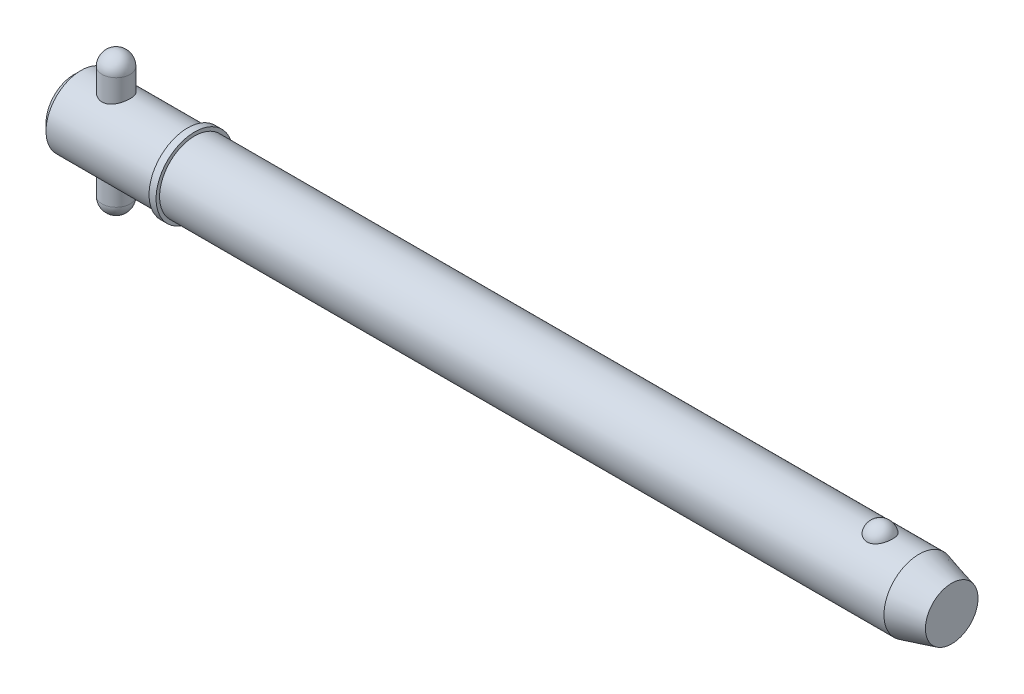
ISO-10303-21;
HEADER;
FILE_DESCRIPTION(('STEP AP214'),'2;1');
FILE_NAME('part.step','',(''),(''),'','','');
FILE_SCHEMA(('AUTOMOTIVE_DESIGN { 1 0 10303 214 1 1 1 1 }'));
ENDSEC;
DATA;
#1=APPLICATION_CONTEXT('core data for automotive mechanical design processes');
#2=APPLICATION_PROTOCOL_DEFINITION('international standard','automotive_design',2000,#1);
#3=PRODUCT_CONTEXT('',#1,'mechanical');
#4=PRODUCT('Part','Part','',(#3));
#5=PRODUCT_RELATED_PRODUCT_CATEGORY('part','',(#4));
#6=PRODUCT_DEFINITION_FORMATION('','',#4);
#7=PRODUCT_DEFINITION_CONTEXT('part definition',#1,'design');
#8=PRODUCT_DEFINITION('design','',#6,#7);
#9=PRODUCT_DEFINITION_SHAPE('','',#8);
#10=(LENGTH_UNIT() NAMED_UNIT(*) SI_UNIT(.MILLI.,.METRE.));
#11=(NAMED_UNIT(*) PLANE_ANGLE_UNIT() SI_UNIT($,.RADIAN.));
#12=(NAMED_UNIT(*) SI_UNIT($,.STERADIAN.) SOLID_ANGLE_UNIT());
#13=UNCERTAINTY_MEASURE_WITH_UNIT(LENGTH_MEASURE(1.E-05),#10,'distance_accuracy_value','');
#14=(GEOMETRIC_REPRESENTATION_CONTEXT(3) GLOBAL_UNCERTAINTY_ASSIGNED_CONTEXT((#13)) GLOBAL_UNIT_ASSIGNED_CONTEXT((#10,
#11,#12)) REPRESENTATION_CONTEXT('',''));
#15=CARTESIAN_POINT('',(0.,0.,0.));
#16=DIRECTION('',(0.,0.,1.));
#17=DIRECTION('',(1.,0.,0.));
#18=AXIS2_PLACEMENT_3D('',#15,#16,#17);
#19=CARTESIAN_POINT('',(9.525,15.875,0.));
#20=DIRECTION('',(0.,-1.,0.));
#21=DIRECTION('',(0.,0.,-1.));
#22=AXIS2_PLACEMENT_3D('',#19,#20,#21);
#23=CYLINDRICAL_SURFACE('',#22,3.175);
#24=CARTESIAN_POINT('',(9.525,-12.7,0.));
#25=DIRECTION('',(0.,-1.,0.));
#26=DIRECTION('',(0.,0.,-1.));
#27=AXIS2_PLACEMENT_3D('',#24,#25,#26);
#28=CIRCLE('',#27,3.175);
#29=CARTESIAN_POINT('',(9.525,-12.7,-3.175));
#30=VERTEX_POINT('',#29);
#31=EDGE_CURVE('P0_E10',#30,#30,#28,.F.);
#32=ORIENTED_EDGE('',*,*,#31,.T.);
#33=EDGE_LOOP('',(#32));
#34=FACE_BOUND('',#33,.T.);
#35=CARTESIAN_POINT('',(9.525,12.7,0.));
#36=DIRECTION('',(0.,-1.,0.));
#37=DIRECTION('',(0.,0.,-1.));
#38=AXIS2_PLACEMENT_3D('',#35,#36,#37);
#39=CIRCLE('',#38,3.175);
#40=CARTESIAN_POINT('',(9.525,12.7,-3.175));
#41=VERTEX_POINT('',#40);
#42=EDGE_CURVE('P0_E21',#41,#41,#39,.T.);
#43=ORIENTED_EDGE('',*,*,#42,.T.);
#44=EDGE_LOOP('',(#43));
#45=FACE_BOUND('',#44,.T.);
#46=ADVANCED_FACE('P0_F14',(#34,#45),#23,.T.);
#47=CARTESIAN_POINT('',(9.525,-12.7,0.));
#48=DIRECTION('',(0.,0.,1.));
#49=DIRECTION('',(1.,0.,0.));
#50=AXIS2_PLACEMENT_3D('',#47,#48,#49);
#51=SPHERICAL_SURFACE('',#50,3.175);
#52=CARTESIAN_POINT('',(9.525,-12.7,0.));
#53=DIRECTION('',(0.,-1.,0.));
#54=DIRECTION('',(0.,0.,-1.));
#55=AXIS2_PLACEMENT_3D('',#52,#53,#54);
#56=SPHERICAL_SURFACE('',#55,3.175);
#57=ORIENTED_EDGE('',*,*,#31,.F.);
#58=EDGE_LOOP('',(#57));
#59=FACE_BOUND('',#58,.T.);
#60=ADVANCED_FACE('P0_F29',(#59),#56,.T.);
#61=CARTESIAN_POINT('',(9.525,12.7,0.));
#62=DIRECTION('',(0.,0.,1.));
#63=DIRECTION('',(1.,0.,0.));
#64=AXIS2_PLACEMENT_3D('',#61,#62,#63);
#65=SPHERICAL_SURFACE('',#64,3.175);
#66=CARTESIAN_POINT('',(9.525,12.7,0.));
#67=DIRECTION('',(0.,-1.,0.));
#68=DIRECTION('',(0.,0.,-1.));
#69=AXIS2_PLACEMENT_3D('',#66,#67,#68);
#70=SPHERICAL_SURFACE('',#69,3.175);
#71=ORIENTED_EDGE('',*,*,#42,.F.);
#72=EDGE_LOOP('',(#71));
#73=FACE_BOUND('',#72,.T.);
#74=ADVANCED_FACE('P0_F16',(#73),#70,.T.);
#75=CLOSED_SHELL('',(#46,#60,#74));
#76=MANIFOLD_SOLID_BREP('P0_B1',#75);
#77=CARTESIAN_POINT('',(0.,0.,0.));
#78=DIRECTION('',(1.,0.,0.));
#79=DIRECTION('',(0.,0.,-1.));
#80=AXIS2_PLACEMENT_3D('',#77,#78,#79);
#81=CYLINDRICAL_SURFACE('',#80,7.94);
#82=CARTESIAN_POINT('',(191.351879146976,0.,0.));
#83=DIRECTION('',(1.,0.,0.));
#84=DIRECTION('',(0.,0.,-1.));
#85=AXIS2_PLACEMENT_3D('',#82,#83,#84);
#86=CIRCLE('',#85,7.94);
#87=CARTESIAN_POINT('',(191.351879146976,0.,-7.94));
#88=VERTEX_POINT('',#87);
#89=EDGE_CURVE('P1_E81',#88,#88,#86,.T.);
#90=ORIENTED_EDGE('',*,*,#89,.F.);
#91=EDGE_LOOP('',(#90));
#92=FACE_BOUND('',#91,.T.);
#93=CARTESIAN_POINT('',(27.31,0.,0.));
#94=DIRECTION('',(1.,0.,0.));
#95=DIRECTION('',(0.,0.,-1.));
#96=AXIS2_PLACEMENT_3D('',#93,#94,#95);
#97=CIRCLE('',#96,7.94);
#98=CARTESIAN_POINT('',(27.31,0.,-7.94));
#99=VERTEX_POINT('',#98);
#100=EDGE_CURVE('P1_E85',#99,#99,#97,.T.);
#101=ORIENTED_EDGE('',*,*,#100,.T.);
#102=EDGE_LOOP('',(#101));
#103=FACE_BOUND('',#102,.T.);
#104=CARTESIAN_POINT('',(182.544907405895,7.37767842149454,2.93486986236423));
#105=CARTESIAN_POINT('',(182.392749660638,7.3776732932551,2.93487505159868));
#106=CARTESIAN_POINT('',(182.240632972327,7.38258419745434,2.92262454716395));
#107=CARTESIAN_POINT('',(181.940928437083,7.40163229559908,2.87404196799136));
#108=CARTESIAN_POINT('',(181.793339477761,7.41576720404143,2.83771585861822));
#109=CARTESIAN_POINT('',(181.507018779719,7.45161576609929,2.74218769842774));
#110=CARTESIAN_POINT('',(181.368274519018,7.47331841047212,2.68301886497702));
#111=CARTESIAN_POINT('',(181.102882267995,7.52194082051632,2.54350967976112));
#112=CARTESIAN_POINT('',(180.976236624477,7.54886159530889,2.46316523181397));
#113=CARTESIAN_POINT('',(180.734534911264,7.60594671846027,2.28090375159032));
#114=CARTESIAN_POINT('',(180.619906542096,7.63618114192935,2.1784421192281));
#115=CARTESIAN_POINT('',(180.408878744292,7.69614046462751,1.95608495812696));
#116=CARTESIAN_POINT('',(180.312482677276,7.72586526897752,1.83618622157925));
#117=CARTESIAN_POINT('',(180.135938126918,7.78314821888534,1.57628086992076));
#118=CARTESIAN_POINT('',(180.056707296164,7.81055035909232,1.43561546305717));
#119=CARTESIAN_POINT('',(179.921797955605,7.85879631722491,1.14236334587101));
#120=CARTESIAN_POINT('',(179.866121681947,7.87963951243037,0.989775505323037));
#121=CARTESIAN_POINT('',(179.77881215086,7.91289645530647,0.674619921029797));
#122=CARTESIAN_POINT('',(179.74753090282,7.92518652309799,0.511941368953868));
#123=CARTESIAN_POINT('',(179.710975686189,7.93958930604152,0.183247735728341));
#124=CARTESIAN_POINT('',(179.705701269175,7.94170219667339,0.0172327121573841));
#125=CARTESIAN_POINT('',(179.721231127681,7.93554931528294,-0.312672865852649));
#126=CARTESIAN_POINT('',(179.741925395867,7.92732732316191,-0.476569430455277));
#127=CARTESIAN_POINT('',(179.80878655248,7.90141534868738,-0.79830524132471));
#128=CARTESIAN_POINT('',(179.854953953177,7.88372517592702,-0.956144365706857));
#129=CARTESIAN_POINT('',(179.971898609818,7.84066230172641,-1.26152073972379));
#130=CARTESIAN_POINT('',(180.042704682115,7.81528060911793,-1.40904568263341));
#131=CARTESIAN_POINT('',(180.207478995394,7.75948672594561,-1.68950598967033));
#132=CARTESIAN_POINT('',(180.301448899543,7.72907417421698,-1.82244030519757));
#133=CARTESIAN_POINT('',(180.510839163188,7.66640424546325,-2.07032792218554));
#134=CARTESIAN_POINT('',(180.626315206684,7.63414223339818,-2.18523308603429));
#135=CARTESIAN_POINT('',(180.8759006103,7.57149681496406,-2.39329737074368));
#136=CARTESIAN_POINT('',(181.010008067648,7.54111321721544,-2.48645870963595));
#137=CARTESIAN_POINT('',(181.290111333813,7.48650742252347,-2.64628132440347));
#138=CARTESIAN_POINT('',(181.435760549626,7.46215900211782,-2.71350554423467));
#139=CARTESIAN_POINT('',(181.737425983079,7.42171253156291,-2.82226614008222));
#140=CARTESIAN_POINT('',(181.893438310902,7.40561140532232,-2.86381209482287));
#141=CARTESIAN_POINT('',(182.202970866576,7.3842679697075,-2.9183907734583));
#142=CARTESIAN_POINT('',(182.356222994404,7.37852109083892,-2.93275024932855));
#143=CARTESIAN_POINT('',(182.663070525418,7.37700973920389,-2.93655208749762));
#144=CARTESIAN_POINT('',(182.816665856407,7.38124333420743,-2.92599927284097));
#145=CARTESIAN_POINT('',(183.114990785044,7.39890635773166,-2.88102897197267));
#146=CARTESIAN_POINT('',(183.259848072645,7.41205491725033,-2.84733999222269));
#147=CARTESIAN_POINT('',(183.54164329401,7.445801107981,-2.75788206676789));
#148=CARTESIAN_POINT('',(183.678580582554,7.46639934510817,-2.70211132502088));
#149=CARTESIAN_POINT('',(183.944061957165,7.51339098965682,-2.56858908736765));
#150=CARTESIAN_POINT('',(184.072354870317,7.53990200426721,-2.4903806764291));
#151=CARTESIAN_POINT('',(184.314244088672,7.59569503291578,-2.31462737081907));
#152=CARTESIAN_POINT('',(184.427837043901,7.6249776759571,-2.21707808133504));
#153=CARTESIAN_POINT('',(184.64322156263,7.68489473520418,-1.99982049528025));
#154=CARTESIAN_POINT('',(184.744148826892,7.71552419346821,-1.87925337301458));
#155=CARTESIAN_POINT('',(184.925186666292,7.77353016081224,-1.6226882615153));
#156=CARTESIAN_POINT('',(185.005293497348,7.80090608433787,-1.48668750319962));
#157=CARTESIAN_POINT('',(185.145361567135,7.85047992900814,-1.1981841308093));
#158=CARTESIAN_POINT('',(185.204587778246,7.87248183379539,-1.04529016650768));
#159=CARTESIAN_POINT('',(185.297982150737,7.90785114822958,-0.731080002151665));
#160=CARTESIAN_POINT('',(185.332149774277,7.92121837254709,-0.569763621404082));
#161=CARTESIAN_POINT('',(185.374795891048,7.93797834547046,-0.242812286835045));
#162=CARTESIAN_POINT('',(185.383204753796,7.94134405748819,-0.0771668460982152));
#163=CARTESIAN_POINT('',(185.373962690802,7.93767937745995,0.253276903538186));
#164=CARTESIAN_POINT('',(185.356312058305,7.93064910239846,0.418075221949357));
#165=CARTESIAN_POINT('',(185.295424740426,7.90695571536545,0.741525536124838));
#166=CARTESIAN_POINT('',(185.252281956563,7.8903279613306,0.900197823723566));
#167=CARTESIAN_POINT('',(185.14135358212,7.84916386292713,1.20759654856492));
#168=CARTESIAN_POINT('',(185.07356656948,7.82462706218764,1.35632241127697));
#169=CARTESIAN_POINT('',(184.914371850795,7.77006699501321,1.64032869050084));
#170=CARTESIAN_POINT('',(184.822861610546,7.74002008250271,1.7755471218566));
#171=CARTESIAN_POINT('',(184.618296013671,7.67774175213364,2.0280064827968));
#172=CARTESIAN_POINT('',(184.505241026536,7.64551037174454,2.14524772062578));
#173=CARTESIAN_POINT('',(184.260831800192,7.58265895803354,2.35778002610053));
#174=CARTESIAN_POINT('',(184.129583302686,7.5520309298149,2.45319004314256));
#175=CARTESIAN_POINT('',(183.851601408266,7.49579792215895,2.61999897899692));
#176=CARTESIAN_POINT('',(183.704867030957,7.4701932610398,2.69139637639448));
#177=CARTESIAN_POINT('',(183.392947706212,7.42622216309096,2.8105324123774));
#178=CARTESIAN_POINT('',(183.227220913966,7.40825002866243,2.85700910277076));
#179=CARTESIAN_POINT('',(182.889279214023,7.38398348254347,2.9191685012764));
#180=CARTESIAN_POINT('',(182.71706702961,7.3776842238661,2.93486399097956));
#181=CARTESIAN_POINT('',(182.544907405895,7.37767842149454,2.93486986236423));
#182=B_SPLINE_CURVE_WITH_KNOTS('',3,(#104,#105,#106,#107,#108,#109,#110,#111,#112,#113,#114,
#115,#116,#117,#118,#119,#120,#121,#122,#123,#124,#125,#126,#127,#128,#129,#130,#131,#132,#133,
#134,#135,#136,#137,#138,#139,#140,#141,#142,#143,#144,#145,#146,#147,#148,#149,#150,#151,#152,
#153,#154,#155,#156,#157,#158,#159,#160,#161,#162,#163,#164,#165,#166,#167,#168,#169,#170,#171,
#172,#173,#174,#175,#176,#177,#178,#179,#180,#181),.UNSPECIFIED.,.T.,.F.,(4,2,2,2,2,2,2,2,2,2,2,
2,2,2,2,2,2,2,2,2,2,2,2,2,2,2,2,2,2,2,2,2,2,2,2,2,2,2,4),(0.,0.455841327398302,
0.911569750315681,1.36663794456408,1.82179423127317,2.2897898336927,2.75787163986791,
3.24685368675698,3.73588214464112,4.23184282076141,4.72779494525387,5.22165321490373,
5.71552141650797,6.2099691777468,6.7044524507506,7.20023431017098,7.69596557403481,
8.18023418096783,8.66432203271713,9.1241069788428,9.58380291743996,10.0296503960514,
10.4755341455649,10.9312349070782,11.3870393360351,11.8654416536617,12.3439299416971,
12.8378875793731,13.3318558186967,13.8271581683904,14.3224549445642,14.8159385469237,
15.3094506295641,15.8051323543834,16.3008055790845,16.7937101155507,17.2866458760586,
17.8026240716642,18.3183879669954),.UNSPECIFIED.);
#183=CARTESIAN_POINT('',(182.544907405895,7.37767842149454,2.93486986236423));
#184=VERTEX_POINT('',#183);
#185=EDGE_CURVE('P1_E35',#184,#184,#182,.T.);
#186=ORIENTED_EDGE('',*,*,#185,.T.);
#187=EDGE_LOOP('',(#186));
#188=FACE_BOUND('',#187,.T.);
#189=ADVANCED_FACE('P1_F13',(#92,#103,#188),#81,.T.);
#190=CARTESIAN_POINT('',(0.,0.,0.));
#191=DIRECTION('',(-1.,0.,0.));
#192=DIRECTION('',(0.,0.,1.));
#193=AXIS2_PLACEMENT_3D('',#190,#191,#192);
#194=PLANE('',#193);
#195=CARTESIAN_POINT('',(0.,0.,0.));
#196=DIRECTION('',(1.,0.,0.));
#197=DIRECTION('',(0.,0.,-1.));
#198=AXIS2_PLACEMENT_3D('',#195,#196,#197);
#199=CIRCLE('',#198,6.352);
#200=CARTESIAN_POINT('',(0.,0.,-6.352));
#201=VERTEX_POINT('',#200);
#202=EDGE_CURVE('P1_E9',#201,#201,#199,.T.);
#203=ORIENTED_EDGE('',*,*,#202,.F.);
#204=EDGE_LOOP('',(#203));
#205=FACE_BOUND('',#204,.T.);
#206=ADVANCED_FACE('P1_F15',(#205),#194,.T.);
#207=CARTESIAN_POINT('',(1.58799999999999,0.,0.));
#208=DIRECTION('',(1.,0.,0.));
#209=DIRECTION('',(0.,0.,-1.));
#210=AXIS2_PLACEMENT_3D('',#207,#208,#209);
#211=CONICAL_SURFACE('',#210,7.94,0.78539816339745);
#212=ORIENTED_EDGE('',*,*,#202,.T.);
#213=EDGE_LOOP('',(#212));
#214=FACE_BOUND('',#213,.T.);
#215=CARTESIAN_POINT('',(1.58799999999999,0.,0.));
#216=DIRECTION('',(1.,0.,0.));
#217=DIRECTION('',(0.,0.,-1.));
#218=AXIS2_PLACEMENT_3D('',#215,#216,#217);
#219=CIRCLE('',#218,7.94);
#220=CARTESIAN_POINT('',(1.58799999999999,0.,-7.94));
#221=VERTEX_POINT('',#220);
#222=EDGE_CURVE('P1_E26',#221,#221,#219,.T.);
#223=ORIENTED_EDGE('',*,*,#222,.F.);
#224=EDGE_LOOP('',(#223));
#225=FACE_BOUND('',#224,.T.);
#226=ADVANCED_FACE('P1_F77',(#214,#225),#211,.T.);
#227=CARTESIAN_POINT('',(0.,0.,0.));
#228=DIRECTION('',(1.,0.,0.));
#229=DIRECTION('',(0.,0.,-1.));
#230=AXIS2_PLACEMENT_3D('',#227,#228,#229);
#231=CYLINDRICAL_SURFACE('',#230,7.94);
#232=CARTESIAN_POINT('',(9.525,-7.27756655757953,3.175));
#233=CARTESIAN_POINT('',(9.43992346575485,-7.27756715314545,3.17499935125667));
#234=CARTESIAN_POINT('',(9.35481882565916,-7.27906496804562,3.1715736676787));
#235=CARTESIAN_POINT('',(9.18524505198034,-7.28499816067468,3.15791803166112));
#236=CARTESIAN_POINT('',(9.100776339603,-7.28943533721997,3.14768391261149));
#237=CARTESIAN_POINT('',(8.84895715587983,-7.30698881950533,3.10684226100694));
#238=CARTESIAN_POINT('',(8.6834173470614,-7.32434654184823,3.06609574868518));
#239=CARTESIAN_POINT('',(8.36278910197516,-7.36806950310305,2.95945910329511));
#240=CARTESIAN_POINT('',(8.20766386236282,-7.39440078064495,2.89366366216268));
#241=CARTESIAN_POINT('',(7.91065319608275,-7.45304562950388,2.73907413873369));
#242=CARTESIAN_POINT('',(7.76876488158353,-7.48535789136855,2.65028508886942));
#243=CARTESIAN_POINT('',(7.49411086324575,-7.55439482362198,2.44679888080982));
#244=CARTESIAN_POINT('',(7.36219910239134,-7.59126138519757,2.33099745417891));
#245=CARTESIAN_POINT('',(7.11904234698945,-7.66408045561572,2.07909838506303));
#246=CARTESIAN_POINT('',(7.00780457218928,-7.70003264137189,1.94299368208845));
#247=CARTESIAN_POINT('',(6.80492173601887,-7.76867514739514,1.64775981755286));
#248=CARTESIAN_POINT('',(6.71422139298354,-7.80118112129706,1.48793473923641));
#249=CARTESIAN_POINT('',(6.56135788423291,-7.85754918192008,1.15376269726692));
#250=CARTESIAN_POINT('',(6.49918311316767,-7.88141478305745,0.979421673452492));
#251=CARTESIAN_POINT('',(6.40818142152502,-7.91680873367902,0.630115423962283));
#252=CARTESIAN_POINT('',(6.3778864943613,-7.9288781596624,0.455588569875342));
#253=CARTESIAN_POINT('',(6.34677743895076,-7.94127547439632,0.103539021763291));
#254=CARTESIAN_POINT('',(6.34595232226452,-7.94160773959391,-0.0739825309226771));
#255=CARTESIAN_POINT('',(6.37300128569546,-7.93082261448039,-0.416371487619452));
#256=CARTESIAN_POINT('',(6.39926693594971,-7.92034690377,-0.581389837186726));
#257=CARTESIAN_POINT('',(6.47701615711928,-7.88998770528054,-0.904449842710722));
#258=CARTESIAN_POINT('',(6.52850157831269,-7.87010352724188,-1.06249098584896));
#259=CARTESIAN_POINT('',(6.65586120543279,-7.82249343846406,-1.36995769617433));
#260=CARTESIAN_POINT('',(6.73209124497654,-7.79465387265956,-1.51921754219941));
#261=CARTESIAN_POINT('',(6.90644286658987,-7.73389606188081,-1.80321183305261));
#262=CARTESIAN_POINT('',(7.00457194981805,-7.70097607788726,-1.93794127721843));
#263=CARTESIAN_POINT('',(7.22744086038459,-7.63084889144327,-2.19843606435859));
#264=CARTESIAN_POINT('',(7.35350432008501,-7.59350211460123,-2.3230330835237));
#265=CARTESIAN_POINT('',(7.62488266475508,-7.52039654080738,-2.54979642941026));
#266=CARTESIAN_POINT('',(7.77020381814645,-7.48463826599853,-2.65195542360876));
#267=CARTESIAN_POINT('',(8.08119298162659,-7.41780943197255,-2.83361305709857));
#268=CARTESIAN_POINT('',(8.24731937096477,-7.38689959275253,-2.91239105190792));
#269=CARTESIAN_POINT('',(8.59204539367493,-7.33515216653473,-3.04038913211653));
#270=CARTESIAN_POINT('',(8.77063684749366,-7.31430804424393,-3.08962840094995));
#271=CARTESIAN_POINT('',(9.12356982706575,-7.28663831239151,-3.15431018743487));
#272=CARTESIAN_POINT('',(9.29750494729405,-7.2790344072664,-3.17163284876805));
#273=CARTESIAN_POINT('',(9.64592502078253,-7.27648884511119,-3.17747282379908));
#274=CARTESIAN_POINT('',(9.82040979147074,-7.28154335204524,-3.16599886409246));
#275=CARTESIAN_POINT('',(10.1545374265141,-7.30294638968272,-3.11628310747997));
#276=CARTESIAN_POINT('',(10.3144598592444,-7.31863587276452,-3.0796016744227));
#277=CARTESIAN_POINT('',(10.625774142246,-7.35872371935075,-2.98253618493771));
#278=CARTESIAN_POINT('',(10.7771640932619,-7.38312401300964,-2.92214687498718));
#279=CARTESIAN_POINT('',(11.0739599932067,-7.4390944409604,-2.77664664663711));
#280=CARTESIAN_POINT('',(11.2188745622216,-7.47091513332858,-2.69063278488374));
#281=CARTESIAN_POINT('',(11.4928722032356,-7.53775867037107,-2.49724834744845));
#282=CARTESIAN_POINT('',(11.6219487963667,-7.57278281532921,-2.38986907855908));
#283=CARTESIAN_POINT('',(11.8705091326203,-7.64520845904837,-2.1474449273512));
#284=CARTESIAN_POINT('',(11.9885816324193,-7.68259462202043,-2.01094304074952));
#285=CARTESIAN_POINT('',(12.2003631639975,-7.75309951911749,-1.71917041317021));
#286=CARTESIAN_POINT('',(12.2940712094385,-7.78621808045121,-1.56389891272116));
#287=CARTESIAN_POINT('',(12.4541161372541,-7.84456050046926,-1.23845027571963));
#288=CARTESIAN_POINT('',(12.5204600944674,-7.86978639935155,-1.06827700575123));
#289=CARTESIAN_POINT('',(12.6231407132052,-7.90943635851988,-0.717928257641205));
#290=CARTESIAN_POINT('',(12.6594936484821,-7.92386627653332,-0.537758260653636));
#291=CARTESIAN_POINT('',(12.6992281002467,-7.93967263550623,-0.185201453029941));
#292=CARTESIAN_POINT('',(12.7046050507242,-7.94183891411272,-0.0130732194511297));
#293=CARTESIAN_POINT('',(12.6875036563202,-7.9350072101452,0.329549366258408));
#294=CARTESIAN_POINT('',(12.6650295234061,-7.92601091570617,0.500043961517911));
#295=CARTESIAN_POINT('',(12.5942896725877,-7.89825976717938,0.829196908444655));
#296=CARTESIAN_POINT('',(12.5468364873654,-7.87981280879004,0.988057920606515));
#297=CARTESIAN_POINT('',(12.4283390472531,-7.83513565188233,1.29553461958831));
#298=CARTESIAN_POINT('',(12.3572904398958,-7.8089040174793,1.44414841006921));
#299=CARTESIAN_POINT('',(12.1900822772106,-7.7497911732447,1.73412879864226));
#300=CARTESIAN_POINT('',(12.0929519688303,-7.71666737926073,1.87488510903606));
#301=CARTESIAN_POINT('',(11.8777894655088,-7.64775894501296,2.13869231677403));
#302=CARTESIAN_POINT('',(11.7597486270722,-7.61197320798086,2.26173585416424));
#303=CARTESIAN_POINT('',(11.4974896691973,-7.53902341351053,2.49449755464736));
#304=CARTESIAN_POINT('',(11.3521039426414,-7.50191102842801,2.60292060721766));
#305=CARTESIAN_POINT('',(11.0440201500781,-7.43289551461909,2.79392602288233));
#306=CARTESIAN_POINT('',(10.8813200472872,-7.40099299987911,2.87650534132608));
#307=CARTESIAN_POINT('',(10.558064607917,-7.3489506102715,3.00682739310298));
#308=CARTESIAN_POINT('',(10.398627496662,-7.32801197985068,3.05703164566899));
#309=CARTESIAN_POINT('',(10.0731242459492,-7.29639491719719,3.13175843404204));
#310=CARTESIAN_POINT('',(9.90707793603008,-7.28568789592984,3.15635254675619));
#311=CARTESIAN_POINT('',(9.70441566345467,-7.27968826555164,3.17013149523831));
#312=CARTESIAN_POINT('',(9.66856669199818,-7.27889378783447,3.17195593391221));
#313=CARTESIAN_POINT('',(9.59681348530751,-7.27783278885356,3.17439036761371));
#314=CARTESIAN_POINT('',(9.56090924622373,-7.27756630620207,3.17500027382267));
#315=CARTESIAN_POINT('',(9.525,-7.27756655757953,3.175));
#316=B_SPLINE_CURVE_WITH_KNOTS('',3,(#232,#233,#234,#235,#236,#237,#238,#239,#240,#241,#242,
#243,#244,#245,#246,#247,#248,#249,#250,#251,#252,#253,#254,#255,#256,#257,#258,#259,#260,#261,
#262,#263,#264,#265,#266,#267,#268,#269,#270,#271,#272,#273,#274,#275,#276,#277,#278,#279,#280,
#281,#282,#283,#284,#285,#286,#287,#288,#289,#290,#291,#292,#293,#294,#295,#296,#297,#298,#299,
#300,#301,#302,#303,#304,#305,#306,#307,#308,#309,#310,#311,#312,#313,#314,#315),.UNSPECIFIED.,
.T.,.F.,(4,2,2,2,2,2,2,2,2,2,2,2,2,2,2,2,2,2,2,2,2,2,2,2,2,2,2,2,2,2,2,2,2,2,2,2,2,2,2,2,2,4),
(0.,0.255187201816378,0.510530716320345,1.0218798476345,1.53131482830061,2.04063840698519,
2.57635929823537,3.11226692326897,3.66929090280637,4.22608806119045,4.75594400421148,
5.28560237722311,5.78552836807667,6.28549104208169,6.79298787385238,7.30065880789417,
7.8416422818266,8.38280228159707,8.93923025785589,9.49529647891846,10.0174074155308,
10.5393601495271,11.0316114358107,11.5239718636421,12.0362920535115,12.5488211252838,
13.0991799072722,13.6495609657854,14.1997996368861,14.7497395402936,15.2638187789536,
15.7778202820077,16.2760504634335,16.7743726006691,17.294711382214,17.8152657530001,
18.3680208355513,18.9208410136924,19.4240423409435,19.9258334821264,20.0335354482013,
20.1412452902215),.UNSPECIFIED.);
#317=CARTESIAN_POINT('',(9.525,-7.27756655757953,3.175));
#318=VERTEX_POINT('',#317);
#319=EDGE_CURVE('P1_E17',#318,#318,#316,.T.);
#320=ORIENTED_EDGE('',*,*,#319,.F.);
#321=EDGE_LOOP('',(#320));
#322=FACE_BOUND('',#321,.T.);
#323=CARTESIAN_POINT('',(9.525,7.27756655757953,3.175));
#324=CARTESIAN_POINT('',(9.61007653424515,7.27756715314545,3.17499935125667));
#325=CARTESIAN_POINT('',(9.69518117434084,7.27906496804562,3.1715736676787));
#326=CARTESIAN_POINT('',(9.86475494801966,7.28499816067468,3.15791803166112));
#327=CARTESIAN_POINT('',(9.949223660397,7.28943533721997,3.14768391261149));
#328=CARTESIAN_POINT('',(10.2010428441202,7.30698881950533,3.10684226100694));
#329=CARTESIAN_POINT('',(10.3665826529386,7.32434654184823,3.06609574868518));
#330=CARTESIAN_POINT('',(10.6872108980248,7.36806950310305,2.95945910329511));
#331=CARTESIAN_POINT('',(10.8423361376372,7.39440078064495,2.89366366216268));
#332=CARTESIAN_POINT('',(11.1393468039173,7.45304562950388,2.73907413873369));
#333=CARTESIAN_POINT('',(11.2812351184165,7.48535789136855,2.65028508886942));
#334=CARTESIAN_POINT('',(11.5558891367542,7.55439482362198,2.44679888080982));
#335=CARTESIAN_POINT('',(11.6878008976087,7.59126138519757,2.33099745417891));
#336=CARTESIAN_POINT('',(11.9309576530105,7.66408045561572,2.07909838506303));
#337=CARTESIAN_POINT('',(12.0421954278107,7.70003264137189,1.94299368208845));
#338=CARTESIAN_POINT('',(12.2450782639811,7.76867514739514,1.64775981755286));
#339=CARTESIAN_POINT('',(12.3357786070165,7.80118112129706,1.48793473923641));
#340=CARTESIAN_POINT('',(12.4886421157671,7.85754918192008,1.15376269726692));
#341=CARTESIAN_POINT('',(12.5508168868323,7.88141478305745,0.979421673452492));
#342=CARTESIAN_POINT('',(12.641818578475,7.91680873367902,0.630115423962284));
#343=CARTESIAN_POINT('',(12.6721135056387,7.9288781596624,0.455588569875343));
#344=CARTESIAN_POINT('',(12.7032225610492,7.94127547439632,0.103539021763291));
#345=CARTESIAN_POINT('',(12.7040476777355,7.94160773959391,-0.0739825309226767));
#346=CARTESIAN_POINT('',(12.6769987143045,7.93082261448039,-0.416371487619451));
#347=CARTESIAN_POINT('',(12.6507330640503,7.92034690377,-0.581389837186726));
#348=CARTESIAN_POINT('',(12.5729838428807,7.88998770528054,-0.904449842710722));
#349=CARTESIAN_POINT('',(12.5214984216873,7.87010352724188,-1.06249098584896));
#350=CARTESIAN_POINT('',(12.3941387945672,7.82249343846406,-1.36995769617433));
#351=CARTESIAN_POINT('',(12.3179087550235,7.79465387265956,-1.51921754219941));
#352=CARTESIAN_POINT('',(12.1435571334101,7.73389606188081,-1.80321183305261));
#353=CARTESIAN_POINT('',(12.0454280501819,7.70097607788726,-1.93794127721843));
#354=CARTESIAN_POINT('',(11.8225591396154,7.63084889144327,-2.19843606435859));
#355=CARTESIAN_POINT('',(11.696495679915,7.59350211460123,-2.3230330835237));
#356=CARTESIAN_POINT('',(11.4251173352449,7.52039654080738,-2.54979642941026));
#357=CARTESIAN_POINT('',(11.2797961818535,7.48463826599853,-2.65195542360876));
#358=CARTESIAN_POINT('',(10.9688070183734,7.41780943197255,-2.83361305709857));
#359=CARTESIAN_POINT('',(10.8026806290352,7.38689959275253,-2.91239105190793));
#360=CARTESIAN_POINT('',(10.4579546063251,7.33515216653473,-3.04038913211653));
#361=CARTESIAN_POINT('',(10.2793631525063,7.31430804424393,-3.08962840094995));
#362=CARTESIAN_POINT('',(9.92643017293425,7.28663831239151,-3.15431018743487));
#363=CARTESIAN_POINT('',(9.75249505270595,7.2790344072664,-3.17163284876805));
#364=CARTESIAN_POINT('',(9.40407497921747,7.2764888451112,-3.17747282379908));
#365=CARTESIAN_POINT('',(9.22959020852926,7.28154335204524,-3.16599886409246));
#366=CARTESIAN_POINT('',(8.89546257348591,7.30294638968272,-3.11628310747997));
#367=CARTESIAN_POINT('',(8.73554014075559,7.31863587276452,-3.0796016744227));
#368=CARTESIAN_POINT('',(8.42422585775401,7.35872371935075,-2.98253618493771));
#369=CARTESIAN_POINT('',(8.27283590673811,7.38312401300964,-2.92214687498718));
#370=CARTESIAN_POINT('',(7.97604000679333,7.4390944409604,-2.77664664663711));
#371=CARTESIAN_POINT('',(7.83112543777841,7.47091513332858,-2.69063278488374));
#372=CARTESIAN_POINT('',(7.55712779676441,7.53775867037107,-2.49724834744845));
#373=CARTESIAN_POINT('',(7.42805120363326,7.57278281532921,-2.38986907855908));
#374=CARTESIAN_POINT('',(7.17949086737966,7.64520845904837,-2.1474449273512));
#375=CARTESIAN_POINT('',(7.06141836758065,7.68259462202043,-2.01094304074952));
#376=CARTESIAN_POINT('',(6.8496368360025,7.75309951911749,-1.71917041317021));
#377=CARTESIAN_POINT('',(6.75592879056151,7.78621808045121,-1.56389891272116));
#378=CARTESIAN_POINT('',(6.59588386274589,7.84456050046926,-1.23845027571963));
#379=CARTESIAN_POINT('',(6.52953990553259,7.86978639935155,-1.06827700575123));
#380=CARTESIAN_POINT('',(6.42685928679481,7.90943635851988,-0.717928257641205));
#381=CARTESIAN_POINT('',(6.39050635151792,7.92386627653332,-0.537758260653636));
#382=CARTESIAN_POINT('',(6.35077189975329,7.93967263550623,-0.18520145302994));
#383=CARTESIAN_POINT('',(6.34539494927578,7.94183891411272,-0.0130732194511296));
#384=CARTESIAN_POINT('',(6.36249634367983,7.9350072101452,0.329549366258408));
#385=CARTESIAN_POINT('',(6.38497047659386,7.92601091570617,0.500043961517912));
#386=CARTESIAN_POINT('',(6.45571032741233,7.89825976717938,0.829196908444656));
#387=CARTESIAN_POINT('',(6.50316351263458,7.87981280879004,0.988057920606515));
#388=CARTESIAN_POINT('',(6.62166095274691,7.83513565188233,1.29553461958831));
#389=CARTESIAN_POINT('',(6.69270956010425,7.8089040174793,1.44414841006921));
#390=CARTESIAN_POINT('',(6.85991772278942,7.7497911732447,1.73412879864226));
#391=CARTESIAN_POINT('',(6.95704803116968,7.71666737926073,1.87488510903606));
#392=CARTESIAN_POINT('',(7.17221053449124,7.64775894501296,2.13869231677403));
#393=CARTESIAN_POINT('',(7.29025137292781,7.61197320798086,2.26173585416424));
#394=CARTESIAN_POINT('',(7.55251033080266,7.53902341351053,2.49449755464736));
#395=CARTESIAN_POINT('',(7.69789605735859,7.50191102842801,2.60292060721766));
#396=CARTESIAN_POINT('',(8.00597984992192,7.43289551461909,2.79392602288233));
#397=CARTESIAN_POINT('',(8.16867995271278,7.40099299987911,2.87650534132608));
#398=CARTESIAN_POINT('',(8.49193539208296,7.3489506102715,3.00682739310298));
#399=CARTESIAN_POINT('',(8.65137250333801,7.32801197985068,3.05703164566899));
#400=CARTESIAN_POINT('',(8.97687575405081,7.29639491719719,3.13175843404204));
#401=CARTESIAN_POINT('',(9.14292206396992,7.28568789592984,3.15635254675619));
#402=CARTESIAN_POINT('',(9.34558433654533,7.27968826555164,3.17013149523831));
#403=CARTESIAN_POINT('',(9.38143330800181,7.27889378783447,3.17195593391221));
#404=CARTESIAN_POINT('',(9.45318651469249,7.27783278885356,3.17439036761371));
#405=CARTESIAN_POINT('',(9.48909075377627,7.27756630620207,3.17500027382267));
#406=CARTESIAN_POINT('',(9.525,7.27756655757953,3.175));
#407=B_SPLINE_CURVE_WITH_KNOTS('',3,(#323,#324,#325,#326,#327,#328,#329,#330,#331,#332,#333,
#334,#335,#336,#337,#338,#339,#340,#341,#342,#343,#344,#345,#346,#347,#348,#349,#350,#351,#352,
#353,#354,#355,#356,#357,#358,#359,#360,#361,#362,#363,#364,#365,#366,#367,#368,#369,#370,#371,
#372,#373,#374,#375,#376,#377,#378,#379,#380,#381,#382,#383,#384,#385,#386,#387,#388,#389,#390,
#391,#392,#393,#394,#395,#396,#397,#398,#399,#400,#401,#402,#403,#404,#405,#406),.UNSPECIFIED.,
.T.,.F.,(4,2,2,2,2,2,2,2,2,2,2,2,2,2,2,2,2,2,2,2,2,2,2,2,2,2,2,2,2,2,2,2,2,2,2,2,2,2,2,2,2,4),
(0.,0.255187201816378,0.510530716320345,1.0218798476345,1.53131482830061,2.04063840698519,
2.57635929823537,3.11226692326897,3.66929090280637,4.22608806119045,4.75594400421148,
5.2856023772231,5.78552836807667,6.28549104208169,6.79298787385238,7.30065880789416,
7.8416422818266,8.38280228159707,8.9392302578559,9.49529647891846,10.0174074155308,
10.5393601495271,11.0316114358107,11.5239718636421,12.0362920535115,12.5488211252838,
13.0991799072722,13.6495609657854,14.1997996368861,14.7497395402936,15.2638187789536,
15.7778202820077,16.2760504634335,16.7743726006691,17.294711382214,17.8152657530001,
18.3680208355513,18.9208410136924,19.4240423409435,19.9258334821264,20.0335354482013,
20.1412452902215),.UNSPECIFIED.);
#408=CARTESIAN_POINT('',(9.525,7.27756655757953,3.175));
#409=VERTEX_POINT('',#408);
#410=EDGE_CURVE('P1_E43',#409,#409,#407,.T.);
#411=ORIENTED_EDGE('',*,*,#410,.F.);
#412=EDGE_LOOP('',(#411));
#413=FACE_BOUND('',#412,.T.);
#414=ORIENTED_EDGE('',*,*,#222,.T.);
#415=EDGE_LOOP('',(#414));
#416=FACE_BOUND('',#415,.T.);
#417=CARTESIAN_POINT('',(25.722,0.,0.));
#418=DIRECTION('',(1.,0.,0.));
#419=DIRECTION('',(0.,0.,-1.));
#420=AXIS2_PLACEMENT_3D('',#417,#418,#419);
#421=CIRCLE('',#420,7.94);
#422=CARTESIAN_POINT('',(25.722,0.,-7.94));
#423=VERTEX_POINT('',#422);
#424=EDGE_CURVE('P1_E31',#423,#423,#421,.T.);
#425=ORIENTED_EDGE('',*,*,#424,.F.);
#426=EDGE_LOOP('',(#425));
#427=FACE_BOUND('',#426,.T.);
#428=ADVANCED_FACE('P1_F103',(#322,#413,#416,#427),#231,.T.);
#429=CARTESIAN_POINT('',(25.722,7.94,0.));
#430=DIRECTION('',(-1.,0.,0.));
#431=DIRECTION('',(0.,0.,1.));
#432=AXIS2_PLACEMENT_3D('',#429,#430,#431);
#433=PLANE('',#432);
#434=ORIENTED_EDGE('',*,*,#424,.T.);
#435=EDGE_LOOP('',(#434));
#436=FACE_BOUND('',#435,.T.);
#437=CARTESIAN_POINT('',(25.722,0.,0.));
#438=DIRECTION('',(1.,0.,0.));
#439=DIRECTION('',(0.,0.,-1.));
#440=AXIS2_PLACEMENT_3D('',#437,#438,#439);
#441=CIRCLE('',#440,8.734);
#442=CARTESIAN_POINT('',(25.722,0.,-8.734));
#443=VERTEX_POINT('',#442);
#444=EDGE_CURVE('P1_E91',#443,#443,#441,.T.);
#445=ORIENTED_EDGE('',*,*,#444,.F.);
#446=EDGE_LOOP('',(#445));
#447=FACE_BOUND('',#446,.T.);
#448=ADVANCED_FACE('P1_F100',(#436,#447),#433,.T.);
#449=CARTESIAN_POINT('',(0.,0.,0.));
#450=DIRECTION('',(1.,0.,0.));
#451=DIRECTION('',(0.,0.,-1.));
#452=AXIS2_PLACEMENT_3D('',#449,#450,#451);
#453=CYLINDRICAL_SURFACE('',#452,8.734);
#454=ORIENTED_EDGE('',*,*,#444,.T.);
#455=EDGE_LOOP('',(#454));
#456=FACE_BOUND('',#455,.T.);
#457=CARTESIAN_POINT('',(27.31,0.,0.));
#458=DIRECTION('',(1.,0.,0.));
#459=DIRECTION('',(0.,0.,-1.));
#460=AXIS2_PLACEMENT_3D('',#457,#458,#459);
#461=CIRCLE('',#460,8.734);
#462=CARTESIAN_POINT('',(27.31,0.,-8.734));
#463=VERTEX_POINT('',#462);
#464=EDGE_CURVE('P1_E88',#463,#463,#461,.T.);
#465=ORIENTED_EDGE('',*,*,#464,.F.);
#466=EDGE_LOOP('',(#465));
#467=FACE_BOUND('',#466,.T.);
#468=ADVANCED_FACE('P1_F68',(#456,#467),#453,.T.);
#469=CARTESIAN_POINT('',(27.31,8.734,0.));
#470=DIRECTION('',(1.,0.,0.));
#471=DIRECTION('',(0.,0.,-1.));
#472=AXIS2_PLACEMENT_3D('',#469,#470,#471);
#473=PLANE('',#472);
#474=ORIENTED_EDGE('',*,*,#464,.T.);
#475=EDGE_LOOP('',(#474));
#476=FACE_BOUND('',#475,.T.);
#477=ORIENTED_EDGE('',*,*,#100,.F.);
#478=EDGE_LOOP('',(#477));
#479=FACE_BOUND('',#478,.T.);
#480=ADVANCED_FACE('P1_F62',(#476,#479),#473,.T.);
#481=CARTESIAN_POINT('',(198.76,0.,0.));
#482=DIRECTION('',(-1.,0.,0.));
#483=DIRECTION('',(0.,0.,1.));
#484=AXIS2_PLACEMENT_3D('',#481,#482,#483);
#485=CONICAL_SURFACE('',#484,5.95500000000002,0.261799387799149);
#486=ORIENTED_EDGE('',*,*,#89,.T.);
#487=EDGE_LOOP('',(#486));
#488=FACE_BOUND('',#487,.T.);
#489=CARTESIAN_POINT('',(198.76,0.,0.));
#490=DIRECTION('',(1.,0.,0.));
#491=DIRECTION('',(0.,0.,-1.));
#492=AXIS2_PLACEMENT_3D('',#489,#490,#491);
#493=CIRCLE('',#492,5.95500000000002);
#494=CARTESIAN_POINT('',(198.76,0.,-5.95500000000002));
#495=VERTEX_POINT('',#494);
#496=EDGE_CURVE('P1_E42',#495,#495,#493,.T.);
#497=ORIENTED_EDGE('',*,*,#496,.F.);
#498=EDGE_LOOP('',(#497));
#499=FACE_BOUND('',#498,.T.);
#500=ADVANCED_FACE('P1_F59',(#488,#499),#485,.T.);
#501=CARTESIAN_POINT('',(198.76,5.95500000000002,0.));
#502=DIRECTION('',(1.,0.,0.));
#503=DIRECTION('',(0.,0.,-1.));
#504=AXIS2_PLACEMENT_3D('',#501,#502,#503);
#505=PLANE('',#504);
#506=ORIENTED_EDGE('',*,*,#496,.T.);
#507=EDGE_LOOP('',(#506));
#508=FACE_BOUND('',#507,.T.);
#509=ADVANCED_FACE('P1_F55',(#508),#505,.T.);
#510=CARTESIAN_POINT('',(182.544907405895,7.146,0.));
#511=DIRECTION('',(-1.,0.,0.));
#512=DIRECTION('',(0.,1.,0.));
#513=AXIS2_PLACEMENT_3D('',#510,#511,#512);
#514=SPHERICAL_SURFACE('',#513,2.944);
#515=ORIENTED_EDGE('',*,*,#185,.F.);
#516=EDGE_LOOP('',(#515));
#517=FACE_BOUND('',#516,.T.);
#518=ADVANCED_FACE('P1_F50',(#517),#514,.T.);
#519=CARTESIAN_POINT('',(9.525,-8.734,0.));
#520=DIRECTION('',(0.,1.,0.));
#521=DIRECTION('',(0.,0.,1.));
#522=AXIS2_PLACEMENT_3D('',#519,#520,#521);
#523=CYLINDRICAL_SURFACE('',#522,3.175);
#524=ORIENTED_EDGE('',*,*,#319,.T.);
#525=EDGE_LOOP('',(#524));
#526=FACE_BOUND('',#525,.T.);
#527=ORIENTED_EDGE('',*,*,#410,.T.);
#528=EDGE_LOOP('',(#527));
#529=FACE_BOUND('',#528,.T.);
#530=ADVANCED_FACE('P1_F54',(#526,#529),#523,.F.);
#531=CLOSED_SHELL('',(#189,#206,#226,#428,#448,#468,#480,#500,#509,#518,#530));
#532=MANIFOLD_SOLID_BREP('P1_B1',#531);
#533=ADVANCED_BREP_SHAPE_REPRESENTATION('',(#18,#76,#532),#14);
#534=SHAPE_DEFINITION_REPRESENTATION(#9,#533);
ENDSEC;
END-ISO-10303-21;
